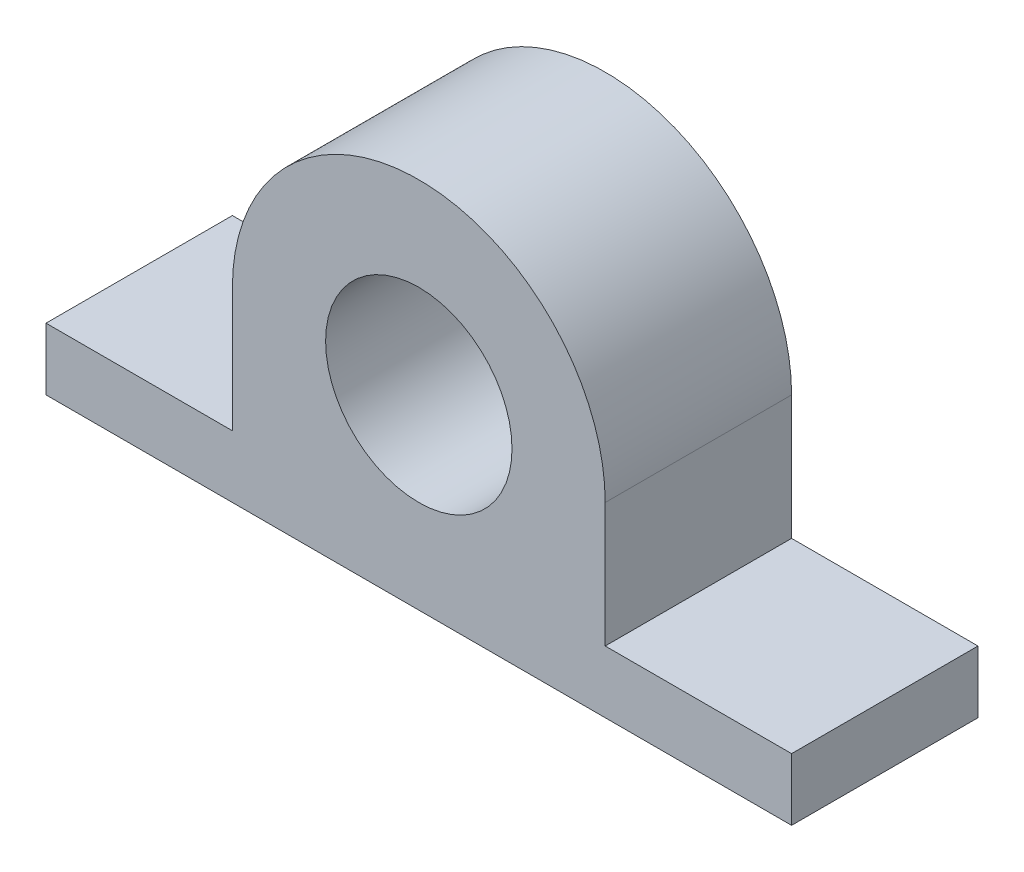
from build123d import *

# Parameters (mm, degrees)
SKETCH1_R           = 15
BOSS_EXTRUDE1_DEPTH = 30


with BuildPart() as part:
    # Sketch1 → Boss-Extrude1 (new body)
    with BuildSketch(Plane.XY):
        with BuildLine():
            Line((10, 10), (130, 10))
            Line((130, 10), (130, 20))
            Line((130, 20), (100, 20))
            Line((100, 20), (100, 40))
            ThreePointArc((100, 40), (70, 70), (40, 40))
            Line((40, 40), (40, 20))
            Line((40, 20), (10, 20))
            Line((10, 20), (10, 10))
        make_face()
        with Locations((70, 40)):
            Circle(SKETCH1_R, mode=Mode.SUBTRACT)
    extrude(amount=BOSS_EXTRUDE1_DEPTH)


solid = part.part
